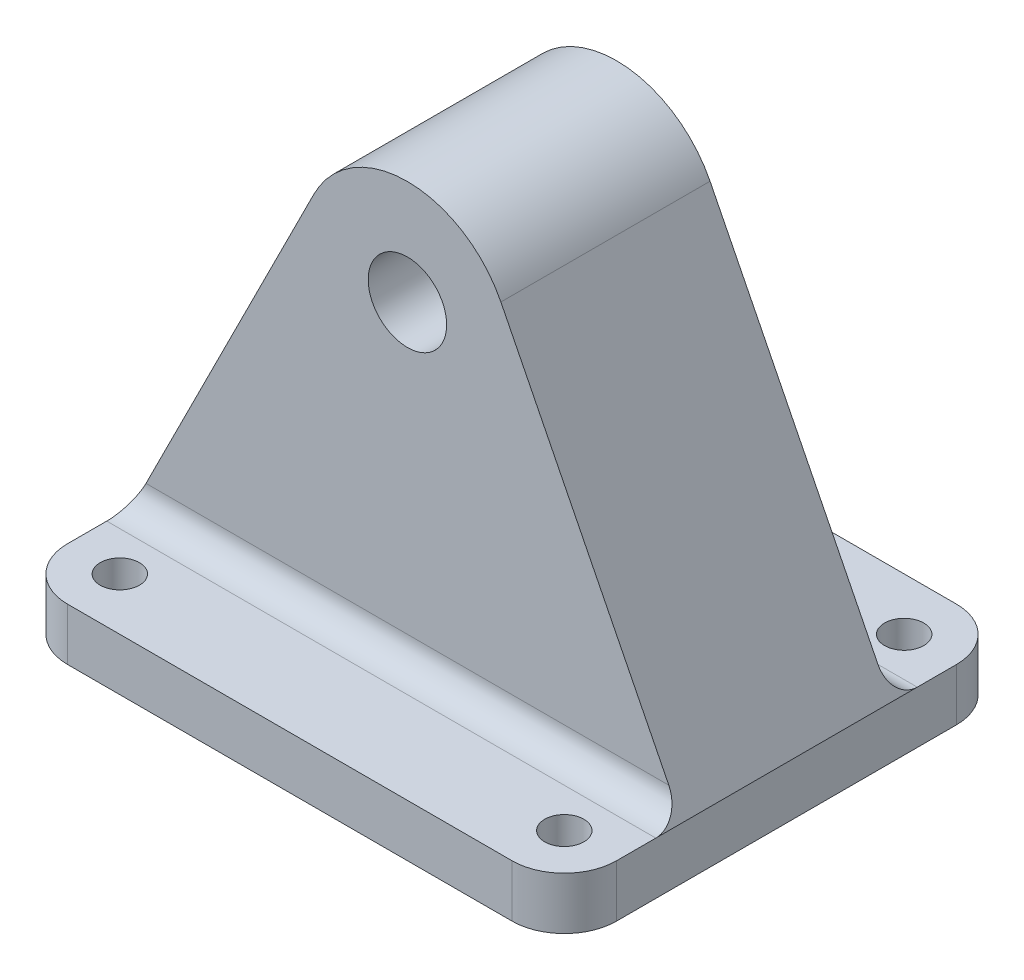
ISO-10303-21;
HEADER;
FILE_DESCRIPTION(('STEP AP214'),'2;1');
FILE_NAME('part.step','',(''),(''),'','','');
FILE_SCHEMA(('AUTOMOTIVE_DESIGN { 1 0 10303 214 1 1 1 1 }'));
ENDSEC;
DATA;
#1=APPLICATION_CONTEXT('core data for automotive mechanical design processes');
#2=APPLICATION_PROTOCOL_DEFINITION('international standard','automotive_design',2000,#1);
#3=PRODUCT_CONTEXT('',#1,'mechanical');
#4=PRODUCT('Part','Part','',(#3));
#5=PRODUCT_RELATED_PRODUCT_CATEGORY('part','',(#4));
#6=PRODUCT_DEFINITION_FORMATION('','',#4);
#7=PRODUCT_DEFINITION_CONTEXT('part definition',#1,'design');
#8=PRODUCT_DEFINITION('design','',#6,#7);
#9=PRODUCT_DEFINITION_SHAPE('','',#8);
#10=(LENGTH_UNIT() NAMED_UNIT(*) SI_UNIT(.MILLI.,.METRE.));
#11=(NAMED_UNIT(*) PLANE_ANGLE_UNIT() SI_UNIT($,.RADIAN.));
#12=(NAMED_UNIT(*) SI_UNIT($,.STERADIAN.) SOLID_ANGLE_UNIT());
#13=UNCERTAINTY_MEASURE_WITH_UNIT(LENGTH_MEASURE(1.E-05),#10,'distance_accuracy_value','');
#14=(GEOMETRIC_REPRESENTATION_CONTEXT(3) GLOBAL_UNCERTAINTY_ASSIGNED_CONTEXT((#13)) GLOBAL_UNIT_ASSIGNED_CONTEXT((#10,
#11,#12)) REPRESENTATION_CONTEXT('',''));
#15=CARTESIAN_POINT('',(0.,0.,0.));
#16=DIRECTION('',(0.,0.,1.));
#17=DIRECTION('',(1.,0.,0.));
#18=AXIS2_PLACEMENT_3D('',#15,#16,#17);
#19=CARTESIAN_POINT('',(-26.9875,6.35,20.6375));
#20=DIRECTION('',(0.,1.,0.));
#21=DIRECTION('',(0.,0.,1.));
#22=AXIS2_PLACEMENT_3D('',#19,#20,#21);
#23=PLANE('',#22);
#24=CARTESIAN_POINT('',(26.9875,6.35,-20.6375));
#25=DIRECTION('',(0.,1.,0.));
#26=DIRECTION('',(0.,0.,1.));
#27=AXIS2_PLACEMENT_3D('',#24,#25,#26);
#28=CIRCLE('',#27,2.38125);
#29=CARTESIAN_POINT('',(26.9875,6.35,-18.25625));
#30=VERTEX_POINT('',#29);
#31=EDGE_CURVE('E183',#30,#30,#28,.T.);
#32=ORIENTED_EDGE('',*,*,#31,.F.);
#33=EDGE_LOOP('',(#32));
#34=FACE_BOUND('',#33,.T.);
#35=CARTESIAN_POINT('',(-26.9875,6.35,-20.6375));
#36=DIRECTION('',(0.,1.,0.));
#37=DIRECTION('',(0.,0.,1.));
#38=AXIS2_PLACEMENT_3D('',#35,#36,#37);
#39=CIRCLE('',#38,2.38125);
#40=CARTESIAN_POINT('',(-26.9875,6.35,-18.25625));
#41=VERTEX_POINT('',#40);
#42=EDGE_CURVE('E189',#41,#41,#39,.T.);
#43=ORIENTED_EDGE('',*,*,#42,.F.);
#44=EDGE_LOOP('',(#43));
#45=FACE_BOUND('',#44,.T.);
#46=DIRECTION('',(0.,0.,1.));
#47=VECTOR('',#46,1.);
#48=CARTESIAN_POINT('',(-33.3375,6.35,-20.6375));
#49=LINE('',#48,#47);
#50=CARTESIAN_POINT('',(-33.3375,6.35,-20.6375));
#51=VERTEX_POINT('',#50);
#52=CARTESIAN_POINT('',(-33.3375,6.35,-15.875));
#53=VERTEX_POINT('',#52);
#54=EDGE_CURVE('E213',#51,#53,#49,.T.);
#55=ORIENTED_EDGE('',*,*,#54,.T.);
#56=DIRECTION('',(1.,0.,0.));
#57=VECTOR('',#56,1.);
#58=CARTESIAN_POINT('',(-26.9875,6.35,-15.875));
#59=LINE('',#58,#57);
#60=CARTESIAN_POINT('',(33.3375,6.35,-15.875));
#61=VERTEX_POINT('',#60);
#62=EDGE_CURVE('E255',#53,#61,#59,.T.);
#63=ORIENTED_EDGE('',*,*,#62,.T.);
#64=DIRECTION('',(0.,0.,-1.));
#65=VECTOR('',#64,1.);
#66=CARTESIAN_POINT('',(33.3375,6.35,-20.6375));
#67=LINE('',#66,#65);
#68=CARTESIAN_POINT('',(33.3375,6.35,-20.6375));
#69=VERTEX_POINT('',#68);
#70=EDGE_CURVE('E203',#61,#69,#67,.T.);
#71=ORIENTED_EDGE('',*,*,#70,.T.);
#72=CARTESIAN_POINT('',(26.9875,6.35,-20.6375));
#73=DIRECTION('',(0.,1.,0.));
#74=DIRECTION('',(0.,0.,1.));
#75=AXIS2_PLACEMENT_3D('',#72,#73,#74);
#76=CIRCLE('',#75,6.35);
#77=CARTESIAN_POINT('',(26.9875,6.35,-26.9875));
#78=VERTEX_POINT('',#77);
#79=EDGE_CURVE('E206',#69,#78,#76,.T.);
#80=ORIENTED_EDGE('',*,*,#79,.T.);
#81=DIRECTION('',(-1.,0.,0.));
#82=VECTOR('',#81,1.);
#83=CARTESIAN_POINT('',(-26.9875,6.35,-26.9875));
#84=LINE('',#83,#82);
#85=CARTESIAN_POINT('',(-26.9875,6.35,-26.9875));
#86=VERTEX_POINT('',#85);
#87=EDGE_CURVE('E208',#78,#86,#84,.T.);
#88=ORIENTED_EDGE('',*,*,#87,.T.);
#89=CARTESIAN_POINT('',(-26.9875,6.35,-20.6375));
#90=DIRECTION('',(0.,1.,0.));
#91=DIRECTION('',(0.,0.,1.));
#92=AXIS2_PLACEMENT_3D('',#89,#90,#91);
#93=CIRCLE('',#92,6.35);
#94=EDGE_CURVE('E210',#86,#51,#93,.T.);
#95=ORIENTED_EDGE('',*,*,#94,.T.);
#96=EDGE_LOOP('',(#55,#63,#71,#80,#88,#95));
#97=FACE_BOUND('',#96,.T.);
#98=ADVANCED_FACE('F33',(#34,#45,#97),#23,.T.);
#99=CARTESIAN_POINT('',(33.3375,6.35,20.6375));
#100=VERTEX_POINT('',#99);
#101=CARTESIAN_POINT('',(33.3375,6.35,15.875));
#102=VERTEX_POINT('',#101);
#103=EDGE_CURVE('E204',#100,#102,#67,.T.);
#104=ORIENTED_EDGE('',*,*,#103,.T.);
#105=DIRECTION('',(1.,0.,0.));
#106=VECTOR('',#105,1.);
#107=CARTESIAN_POINT('',(-33.3375,6.35,15.875));
#108=LINE('',#107,#106);
#109=CARTESIAN_POINT('',(-33.3375,6.35,15.875));
#110=VERTEX_POINT('',#109);
#111=EDGE_CURVE('E261',#102,#110,#108,.F.);
#112=ORIENTED_EDGE('',*,*,#111,.T.);
#113=CARTESIAN_POINT('',(-33.3375,6.35,20.6375));
#114=VERTEX_POINT('',#113);
#115=EDGE_CURVE('E212',#110,#114,#49,.T.);
#116=ORIENTED_EDGE('',*,*,#115,.T.);
#117=CARTESIAN_POINT('',(-26.9875,6.35,20.6375));
#118=DIRECTION('',(0.,1.,0.));
#119=DIRECTION('',(0.,0.,1.));
#120=AXIS2_PLACEMENT_3D('',#117,#118,#119);
#121=CIRCLE('',#120,6.35);
#122=CARTESIAN_POINT('',(-26.9875,6.35,26.9875));
#123=VERTEX_POINT('',#122);
#124=EDGE_CURVE('E195',#114,#123,#121,.T.);
#125=ORIENTED_EDGE('',*,*,#124,.T.);
#126=DIRECTION('',(1.,0.,0.));
#127=VECTOR('',#126,1.);
#128=CARTESIAN_POINT('',(-26.9875,6.35,26.9875));
#129=LINE('',#128,#127);
#130=CARTESIAN_POINT('',(26.9875,6.35,26.9875));
#131=VERTEX_POINT('',#130);
#132=EDGE_CURVE('E198',#123,#131,#129,.T.);
#133=ORIENTED_EDGE('',*,*,#132,.T.);
#134=CARTESIAN_POINT('',(26.9875,6.35,20.6375));
#135=DIRECTION('',(0.,1.,0.));
#136=DIRECTION('',(0.,0.,1.));
#137=AXIS2_PLACEMENT_3D('',#134,#135,#136);
#138=CIRCLE('',#137,6.35000000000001);
#139=EDGE_CURVE('E201',#131,#100,#138,.T.);
#140=ORIENTED_EDGE('',*,*,#139,.T.);
#141=EDGE_LOOP('',(#104,#112,#116,#125,#133,#140));
#142=FACE_BOUND('',#141,.T.);
#143=CARTESIAN_POINT('',(26.9875,6.35,20.6375));
#144=DIRECTION('',(0.,1.,0.));
#145=DIRECTION('',(0.,0.,1.));
#146=AXIS2_PLACEMENT_3D('',#143,#144,#145);
#147=CIRCLE('',#146,2.38125);
#148=CARTESIAN_POINT('',(26.9875,6.35,23.01875));
#149=VERTEX_POINT('',#148);
#150=EDGE_CURVE('E177',#149,#149,#147,.T.);
#151=ORIENTED_EDGE('',*,*,#150,.F.);
#152=EDGE_LOOP('',(#151));
#153=FACE_BOUND('',#152,.T.);
#154=CARTESIAN_POINT('',(-26.9875,6.35,20.6375));
#155=DIRECTION('',(0.,1.,0.));
#156=DIRECTION('',(0.,0.,1.));
#157=AXIS2_PLACEMENT_3D('',#154,#155,#156);
#158=CIRCLE('',#157,2.38125);
#159=CARTESIAN_POINT('',(-26.9875,6.35,23.01875));
#160=VERTEX_POINT('',#159);
#161=EDGE_CURVE('E171',#160,#160,#158,.T.);
#162=ORIENTED_EDGE('',*,*,#161,.F.);
#163=EDGE_LOOP('',(#162));
#164=FACE_BOUND('',#163,.T.);
#165=ADVANCED_FACE('F274',(#142,#153,#164),#23,.T.);
#166=CARTESIAN_POINT('',(-26.9875,0.,20.6375));
#167=DIRECTION('',(0.,1.,0.));
#168=DIRECTION('',(0.,0.,1.));
#169=AXIS2_PLACEMENT_3D('',#166,#167,#168);
#170=PLANE('',#169);
#171=CARTESIAN_POINT('',(-26.9875,0.,20.6375));
#172=DIRECTION('',(0.,1.,0.));
#173=DIRECTION('',(0.,0.,1.));
#174=AXIS2_PLACEMENT_3D('',#171,#172,#173);
#175=CIRCLE('',#174,6.35);
#176=CARTESIAN_POINT('',(-33.3375,0.,20.6375));
#177=VERTEX_POINT('',#176);
#178=CARTESIAN_POINT('',(-26.9875,0.,26.9875));
#179=VERTEX_POINT('',#178);
#180=EDGE_CURVE('E192',#177,#179,#175,.T.);
#181=ORIENTED_EDGE('',*,*,#180,.F.);
#182=DIRECTION('',(0.,0.,1.));
#183=VECTOR('',#182,1.);
#184=CARTESIAN_POINT('',(-33.3375,0.,-20.6375));
#185=LINE('',#184,#183);
#186=CARTESIAN_POINT('',(-33.3375,0.,-20.6375));
#187=VERTEX_POINT('',#186);
#188=EDGE_CURVE('E199',#187,#177,#185,.T.);
#189=ORIENTED_EDGE('',*,*,#188,.F.);
#190=CARTESIAN_POINT('',(-26.9875,0.,-20.6375));
#191=DIRECTION('',(0.,1.,0.));
#192=DIRECTION('',(0.,0.,1.));
#193=AXIS2_PLACEMENT_3D('',#190,#191,#192);
#194=CIRCLE('',#193,6.35);
#195=CARTESIAN_POINT('',(-26.9875,0.,-26.9875));
#196=VERTEX_POINT('',#195);
#197=EDGE_CURVE('E229',#196,#187,#194,.T.);
#198=ORIENTED_EDGE('',*,*,#197,.F.);
#199=DIRECTION('',(-1.,0.,0.));
#200=VECTOR('',#199,1.);
#201=CARTESIAN_POINT('',(-26.9875,0.,-26.9875));
#202=LINE('',#201,#200);
#203=CARTESIAN_POINT('',(26.9875,0.,-26.9875));
#204=VERTEX_POINT('',#203);
#205=EDGE_CURVE('E227',#204,#196,#202,.T.);
#206=ORIENTED_EDGE('',*,*,#205,.F.);
#207=CARTESIAN_POINT('',(26.9875,0.,-20.6375));
#208=DIRECTION('',(0.,1.,0.));
#209=DIRECTION('',(0.,0.,1.));
#210=AXIS2_PLACEMENT_3D('',#207,#208,#209);
#211=CIRCLE('',#210,6.35);
#212=CARTESIAN_POINT('',(33.3375,0.,-20.6375));
#213=VERTEX_POINT('',#212);
#214=EDGE_CURVE('E225',#213,#204,#211,.T.);
#215=ORIENTED_EDGE('',*,*,#214,.F.);
#216=DIRECTION('',(0.,0.,-1.));
#217=VECTOR('',#216,1.);
#218=CARTESIAN_POINT('',(33.3375,0.,-20.6375));
#219=LINE('',#218,#217);
#220=CARTESIAN_POINT('',(33.3375,0.,20.6375));
#221=VERTEX_POINT('',#220);
#222=EDGE_CURVE('E223',#221,#213,#219,.T.);
#223=ORIENTED_EDGE('',*,*,#222,.F.);
#224=CARTESIAN_POINT('',(26.9875,0.,20.6375));
#225=DIRECTION('',(0.,1.,0.));
#226=DIRECTION('',(0.,0.,1.));
#227=AXIS2_PLACEMENT_3D('',#224,#225,#226);
#228=CIRCLE('',#227,6.35000000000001);
#229=CARTESIAN_POINT('',(26.9875,0.,26.9875));
#230=VERTEX_POINT('',#229);
#231=EDGE_CURVE('E221',#230,#221,#228,.T.);
#232=ORIENTED_EDGE('',*,*,#231,.F.);
#233=DIRECTION('',(1.,0.,0.));
#234=VECTOR('',#233,1.);
#235=CARTESIAN_POINT('',(-26.9875,0.,26.9875));
#236=LINE('',#235,#234);
#237=EDGE_CURVE('E219',#179,#230,#236,.T.);
#238=ORIENTED_EDGE('',*,*,#237,.F.);
#239=EDGE_LOOP('',(#181,#189,#198,#206,#215,#223,#232,#238));
#240=FACE_BOUND('',#239,.T.);
#241=CARTESIAN_POINT('',(-26.9875,0.,-20.6375));
#242=DIRECTION('',(0.,1.,0.));
#243=DIRECTION('',(0.,0.,1.));
#244=AXIS2_PLACEMENT_3D('',#241,#242,#243);
#245=CIRCLE('',#244,2.38125);
#246=CARTESIAN_POINT('',(-26.9875,0.,-18.25625));
#247=VERTEX_POINT('',#246);
#248=EDGE_CURVE('E186',#247,#247,#245,.T.);
#249=ORIENTED_EDGE('',*,*,#248,.T.);
#250=EDGE_LOOP('',(#249));
#251=FACE_BOUND('',#250,.T.);
#252=CARTESIAN_POINT('',(26.9875,0.,-20.6375));
#253=DIRECTION('',(0.,1.,0.));
#254=DIRECTION('',(0.,0.,1.));
#255=AXIS2_PLACEMENT_3D('',#252,#253,#254);
#256=CIRCLE('',#255,2.38125);
#257=CARTESIAN_POINT('',(26.9875,0.,-18.25625));
#258=VERTEX_POINT('',#257);
#259=EDGE_CURVE('E180',#258,#258,#256,.T.);
#260=ORIENTED_EDGE('',*,*,#259,.T.);
#261=EDGE_LOOP('',(#260));
#262=FACE_BOUND('',#261,.T.);
#263=CARTESIAN_POINT('',(26.9875,0.,20.6375));
#264=DIRECTION('',(0.,1.,0.));
#265=DIRECTION('',(0.,0.,1.));
#266=AXIS2_PLACEMENT_3D('',#263,#264,#265);
#267=CIRCLE('',#266,2.38125);
#268=CARTESIAN_POINT('',(26.9875,0.,23.01875));
#269=VERTEX_POINT('',#268);
#270=EDGE_CURVE('E174',#269,#269,#267,.T.);
#271=ORIENTED_EDGE('',*,*,#270,.T.);
#272=EDGE_LOOP('',(#271));
#273=FACE_BOUND('',#272,.T.);
#274=CARTESIAN_POINT('',(-26.9875,0.,20.6375));
#275=DIRECTION('',(0.,1.,0.));
#276=DIRECTION('',(0.,0.,1.));
#277=AXIS2_PLACEMENT_3D('',#274,#275,#276);
#278=CIRCLE('',#277,2.38125);
#279=CARTESIAN_POINT('',(-26.9875,0.,23.01875));
#280=VERTEX_POINT('',#279);
#281=EDGE_CURVE('E170',#280,#280,#278,.T.);
#282=ORIENTED_EDGE('',*,*,#281,.T.);
#283=EDGE_LOOP('',(#282));
#284=FACE_BOUND('',#283,.T.);
#285=ADVANCED_FACE('F315',(#240,#251,#262,#273,#284),#170,.F.);
#286=CARTESIAN_POINT('',(-26.9875,6.35,20.6375));
#287=DIRECTION('',(0.,-1.,0.));
#288=DIRECTION('',(0.,0.,-1.));
#289=AXIS2_PLACEMENT_3D('',#286,#287,#288);
#290=CYLINDRICAL_SURFACE('',#289,6.35);
#291=ORIENTED_EDGE('',*,*,#180,.T.);
#292=DIRECTION('',(0.,-1.,0.));
#293=VECTOR('',#292,1.);
#294=CARTESIAN_POINT('',(-26.9875,6.35,26.9875));
#295=LINE('',#294,#293);
#296=EDGE_CURVE('E252',#123,#179,#295,.T.);
#297=ORIENTED_EDGE('',*,*,#296,.F.);
#298=ORIENTED_EDGE('',*,*,#124,.F.);
#299=DIRECTION('',(0.,-1.,0.));
#300=VECTOR('',#299,1.);
#301=CARTESIAN_POINT('',(-33.3375,6.35,20.6375));
#302=LINE('',#301,#300);
#303=EDGE_CURVE('E216',#114,#177,#302,.T.);
#304=ORIENTED_EDGE('',*,*,#303,.T.);
#305=EDGE_LOOP('',(#291,#297,#298,#304));
#306=FACE_BOUND('',#305,.T.);
#307=ADVANCED_FACE('F286',(#306),#290,.T.);
#308=CARTESIAN_POINT('',(-26.9875,6.35,26.9875));
#309=DIRECTION('',(0.,0.,-1.));
#310=DIRECTION('',(-1.,0.,0.));
#311=AXIS2_PLACEMENT_3D('',#308,#309,#310);
#312=PLANE('',#311);
#313=ORIENTED_EDGE('',*,*,#237,.T.);
#314=DIRECTION('',(0.,-1.,0.));
#315=VECTOR('',#314,1.);
#316=CARTESIAN_POINT('',(26.9875,6.35,26.9875));
#317=LINE('',#316,#315);
#318=EDGE_CURVE('E249',#131,#230,#317,.T.);
#319=ORIENTED_EDGE('',*,*,#318,.F.);
#320=ORIENTED_EDGE('',*,*,#132,.F.);
#321=ORIENTED_EDGE('',*,*,#296,.T.);
#322=EDGE_LOOP('',(#313,#319,#320,#321));
#323=FACE_BOUND('',#322,.T.);
#324=ADVANCED_FACE('F291',(#323),#312,.F.);
#325=CARTESIAN_POINT('',(26.9875,6.35,20.6375));
#326=DIRECTION('',(0.,-1.,0.));
#327=DIRECTION('',(0.,0.,-1.));
#328=AXIS2_PLACEMENT_3D('',#325,#326,#327);
#329=CYLINDRICAL_SURFACE('',#328,6.35000000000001);
#330=ORIENTED_EDGE('',*,*,#231,.T.);
#331=DIRECTION('',(0.,-1.,0.));
#332=VECTOR('',#331,1.);
#333=CARTESIAN_POINT('',(33.3375,6.35,20.6375));
#334=LINE('',#333,#332);
#335=EDGE_CURVE('E246',#100,#221,#334,.T.);
#336=ORIENTED_EDGE('',*,*,#335,.F.);
#337=ORIENTED_EDGE('',*,*,#139,.F.);
#338=ORIENTED_EDGE('',*,*,#318,.T.);
#339=EDGE_LOOP('',(#330,#336,#337,#338));
#340=FACE_BOUND('',#339,.T.);
#341=ADVANCED_FACE('F294',(#340),#329,.T.);
#342=CARTESIAN_POINT('',(33.3375,6.35,-20.6375));
#343=DIRECTION('',(-1.,0.,0.));
#344=DIRECTION('',(0.,0.,1.));
#345=AXIS2_PLACEMENT_3D('',#342,#343,#344);
#346=PLANE('',#345);
#347=ORIENTED_EDGE('',*,*,#222,.T.);
#348=DIRECTION('',(0.,-1.,0.));
#349=VECTOR('',#348,1.);
#350=CARTESIAN_POINT('',(33.3375,6.35,-20.6375));
#351=LINE('',#350,#349);
#352=EDGE_CURVE('E243',#69,#213,#351,.T.);
#353=ORIENTED_EDGE('',*,*,#352,.F.);
#354=ORIENTED_EDGE('',*,*,#70,.F.);
#355=DIRECTION('',(0.,0.,-1.));
#356=VECTOR('',#355,1.);
#357=CARTESIAN_POINT('',(33.3375,6.35,12.7));
#358=LINE('',#357,#356);
#359=EDGE_CURVE('E49',#102,#61,#358,.T.);
#360=ORIENTED_EDGE('',*,*,#359,.F.);
#361=ORIENTED_EDGE('',*,*,#103,.F.);
#362=ORIENTED_EDGE('',*,*,#335,.T.);
#363=EDGE_LOOP('',(#347,#353,#354,#360,#361,#362));
#364=FACE_BOUND('',#363,.T.);
#365=ADVANCED_FACE('F296',(#364),#346,.F.);
#366=CARTESIAN_POINT('',(26.9875,6.35,-20.6375));
#367=DIRECTION('',(0.,-1.,0.));
#368=DIRECTION('',(0.,0.,-1.));
#369=AXIS2_PLACEMENT_3D('',#366,#367,#368);
#370=CYLINDRICAL_SURFACE('',#369,6.35);
#371=ORIENTED_EDGE('',*,*,#214,.T.);
#372=DIRECTION('',(0.,-1.,0.));
#373=VECTOR('',#372,1.);
#374=CARTESIAN_POINT('',(26.9875,6.35,-26.9875));
#375=LINE('',#374,#373);
#376=EDGE_CURVE('E240',#78,#204,#375,.T.);
#377=ORIENTED_EDGE('',*,*,#376,.F.);
#378=ORIENTED_EDGE('',*,*,#79,.F.);
#379=ORIENTED_EDGE('',*,*,#352,.T.);
#380=EDGE_LOOP('',(#371,#377,#378,#379));
#381=FACE_BOUND('',#380,.T.);
#382=ADVANCED_FACE('F299',(#381),#370,.T.);
#383=CARTESIAN_POINT('',(-26.9875,6.35,-26.9875));
#384=DIRECTION('',(0.,0.,1.));
#385=DIRECTION('',(1.,0.,0.));
#386=AXIS2_PLACEMENT_3D('',#383,#384,#385);
#387=PLANE('',#386);
#388=ORIENTED_EDGE('',*,*,#205,.T.);
#389=DIRECTION('',(0.,-1.,0.));
#390=VECTOR('',#389,1.);
#391=CARTESIAN_POINT('',(-26.9875,6.35,-26.9875));
#392=LINE('',#391,#390);
#393=EDGE_CURVE('E237',#86,#196,#392,.T.);
#394=ORIENTED_EDGE('',*,*,#393,.F.);
#395=ORIENTED_EDGE('',*,*,#87,.F.);
#396=ORIENTED_EDGE('',*,*,#376,.T.);
#397=EDGE_LOOP('',(#388,#394,#395,#396));
#398=FACE_BOUND('',#397,.T.);
#399=ADVANCED_FACE('F305',(#398),#387,.F.);
#400=CARTESIAN_POINT('',(-26.9875,6.35,-20.6375));
#401=DIRECTION('',(0.,-1.,0.));
#402=DIRECTION('',(0.,0.,-1.));
#403=AXIS2_PLACEMENT_3D('',#400,#401,#402);
#404=CYLINDRICAL_SURFACE('',#403,6.35);
#405=ORIENTED_EDGE('',*,*,#197,.T.);
#406=DIRECTION('',(0.,-1.,0.));
#407=VECTOR('',#406,1.);
#408=CARTESIAN_POINT('',(-33.3375,6.35,-20.6375));
#409=LINE('',#408,#407);
#410=EDGE_CURVE('E234',#51,#187,#409,.T.);
#411=ORIENTED_EDGE('',*,*,#410,.F.);
#412=ORIENTED_EDGE('',*,*,#94,.F.);
#413=ORIENTED_EDGE('',*,*,#393,.T.);
#414=EDGE_LOOP('',(#405,#411,#412,#413));
#415=FACE_BOUND('',#414,.T.);
#416=ADVANCED_FACE('F327',(#415),#404,.T.);
#417=CARTESIAN_POINT('',(-33.3375,6.35,-20.6375));
#418=DIRECTION('',(1.,0.,0.));
#419=DIRECTION('',(0.,0.,-1.));
#420=AXIS2_PLACEMENT_3D('',#417,#418,#419);
#421=PLANE('',#420);
#422=ORIENTED_EDGE('',*,*,#188,.T.);
#423=ORIENTED_EDGE('',*,*,#303,.F.);
#424=ORIENTED_EDGE('',*,*,#115,.F.);
#425=DIRECTION('',(0.,0.,-1.));
#426=VECTOR('',#425,1.);
#427=CARTESIAN_POINT('',(-33.3375,6.35,12.7));
#428=LINE('',#427,#426);
#429=EDGE_CURVE('E157',#110,#53,#428,.T.);
#430=ORIENTED_EDGE('',*,*,#429,.T.);
#431=ORIENTED_EDGE('',*,*,#54,.F.);
#432=ORIENTED_EDGE('',*,*,#410,.T.);
#433=EDGE_LOOP('',(#422,#423,#424,#430,#431,#432));
#434=FACE_BOUND('',#433,.T.);
#435=ADVANCED_FACE('F279',(#434),#421,.F.);
#436=CARTESIAN_POINT('',(-26.9875,6.35,-20.6375));
#437=DIRECTION('',(0.,-1.,0.));
#438=DIRECTION('',(0.,0.,-1.));
#439=AXIS2_PLACEMENT_3D('',#436,#437,#438);
#440=CYLINDRICAL_SURFACE('',#439,2.38125);
#441=ORIENTED_EDGE('',*,*,#42,.T.);
#442=EDGE_LOOP('',(#441));
#443=FACE_BOUND('',#442,.T.);
#444=ORIENTED_EDGE('',*,*,#248,.F.);
#445=EDGE_LOOP('',(#444));
#446=FACE_BOUND('',#445,.T.);
#447=ADVANCED_FACE('F320',(#443,#446),#440,.F.);
#448=CARTESIAN_POINT('',(26.9875,6.35,-20.6375));
#449=DIRECTION('',(0.,-1.,0.));
#450=DIRECTION('',(0.,0.,-1.));
#451=AXIS2_PLACEMENT_3D('',#448,#449,#450);
#452=CYLINDRICAL_SURFACE('',#451,2.38125);
#453=ORIENTED_EDGE('',*,*,#31,.T.);
#454=EDGE_LOOP('',(#453));
#455=FACE_BOUND('',#454,.T.);
#456=ORIENTED_EDGE('',*,*,#259,.F.);
#457=EDGE_LOOP('',(#456));
#458=FACE_BOUND('',#457,.T.);
#459=ADVANCED_FACE('F378',(#455,#458),#452,.F.);
#460=CARTESIAN_POINT('',(26.9875,6.35,20.6375));
#461=DIRECTION('',(0.,-1.,0.));
#462=DIRECTION('',(0.,0.,-1.));
#463=AXIS2_PLACEMENT_3D('',#460,#461,#462);
#464=CYLINDRICAL_SURFACE('',#463,2.38125);
#465=ORIENTED_EDGE('',*,*,#150,.T.);
#466=EDGE_LOOP('',(#465));
#467=FACE_BOUND('',#466,.T.);
#468=ORIENTED_EDGE('',*,*,#270,.F.);
#469=EDGE_LOOP('',(#468));
#470=FACE_BOUND('',#469,.T.);
#471=ADVANCED_FACE('F375',(#467,#470),#464,.F.);
#472=CARTESIAN_POINT('',(-26.9875,6.35,20.6375));
#473=DIRECTION('',(0.,-1.,0.));
#474=DIRECTION('',(0.,0.,-1.));
#475=AXIS2_PLACEMENT_3D('',#472,#473,#474);
#476=CYLINDRICAL_SURFACE('',#475,2.38125);
#477=ORIENTED_EDGE('',*,*,#161,.T.);
#478=EDGE_LOOP('',(#477));
#479=FACE_BOUND('',#478,.T.);
#480=ORIENTED_EDGE('',*,*,#281,.F.);
#481=EDGE_LOOP('',(#480));
#482=FACE_BOUND('',#481,.T.);
#483=ADVANCED_FACE('F372',(#479,#482),#476,.F.);
#484=CARTESIAN_POINT('',(0.,44.45,12.7));
#485=DIRECTION('',(0.,0.,1.));
#486=DIRECTION('',(1.,0.,0.));
#487=AXIS2_PLACEMENT_3D('',#484,#485,#486);
#488=PLANE('',#487);
#489=DIRECTION('',(-0.448657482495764,-0.893703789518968,0.));
#490=VECTOR('',#489,1.);
#491=CARTESIAN_POINT('',(-33.3375,6.35,12.7));
#492=LINE('',#491,#490);
#493=CARTESIAN_POINT('',(-11.3500381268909,50.1479500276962,12.7));
#494=VERTEX_POINT('',#493);
#495=CARTESIAN_POINT('',(-31.7435854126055,9.525,12.7));
#496=VERTEX_POINT('',#495);
#497=EDGE_CURVE('E155',#494,#496,#492,.T.);
#498=ORIENTED_EDGE('',*,*,#497,.T.);
#499=DIRECTION('',(1.,0.,0.));
#500=VECTOR('',#499,1.);
#501=CARTESIAN_POINT('',(33.3375,9.525,12.7));
#502=LINE('',#501,#500);
#503=CARTESIAN_POINT('',(31.7435854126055,9.52500000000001,12.7));
#504=VERTEX_POINT('',#503);
#505=EDGE_CURVE('E138',#496,#504,#502,.T.);
#506=ORIENTED_EDGE('',*,*,#505,.T.);
#507=DIRECTION('',(-0.448657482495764,0.893703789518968,0.));
#508=VECTOR('',#507,1.);
#509=CARTESIAN_POINT('',(11.3500381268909,50.1479500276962,12.7));
#510=LINE('',#509,#508);
#511=CARTESIAN_POINT('',(11.3500381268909,50.1479500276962,12.7));
#512=VERTEX_POINT('',#511);
#513=EDGE_CURVE('E129',#504,#512,#510,.T.);
#514=ORIENTED_EDGE('',*,*,#513,.T.);
#515=CARTESIAN_POINT('',(0.,44.45,12.7));
#516=DIRECTION('',(0.,0.,1.));
#517=DIRECTION('',(1.,0.,0.));
#518=AXIS2_PLACEMENT_3D('',#515,#516,#517);
#519=CIRCLE('',#518,12.7);
#520=EDGE_CURVE('E135',#512,#494,#519,.T.);
#521=ORIENTED_EDGE('',*,*,#520,.T.);
#522=EDGE_LOOP('',(#498,#506,#514,#521));
#523=FACE_BOUND('',#522,.T.);
#524=CARTESIAN_POINT('',(0.,44.45,12.7));
#525=DIRECTION('',(0.,0.,1.));
#526=DIRECTION('',(1.,0.,0.));
#527=AXIS2_PLACEMENT_3D('',#524,#525,#526);
#528=CIRCLE('',#527,4.7625);
#529=CARTESIAN_POINT('',(4.76250000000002,44.45,12.7));
#530=VERTEX_POINT('',#529);
#531=EDGE_CURVE('E163',#530,#530,#528,.T.);
#532=ORIENTED_EDGE('',*,*,#531,.F.);
#533=EDGE_LOOP('',(#532));
#534=FACE_BOUND('',#533,.T.);
#535=ADVANCED_FACE('F132',(#523,#534),#488,.T.);
#536=CARTESIAN_POINT('',(0.,44.45,-12.7));
#537=DIRECTION('',(0.,0.,1.));
#538=DIRECTION('',(1.,0.,0.));
#539=AXIS2_PLACEMENT_3D('',#536,#537,#538);
#540=PLANE('',#539);
#541=DIRECTION('',(-0.448657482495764,0.893703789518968,0.));
#542=VECTOR('',#541,1.);
#543=CARTESIAN_POINT('',(11.3500381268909,50.1479500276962,-12.7));
#544=LINE('',#543,#542);
#545=CARTESIAN_POINT('',(31.7435854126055,9.52500000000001,-12.7));
#546=VERTEX_POINT('',#545);
#547=CARTESIAN_POINT('',(11.3500381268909,50.1479500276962,-12.7));
#548=VERTEX_POINT('',#547);
#549=EDGE_CURVE('E147',#546,#548,#544,.T.);
#550=ORIENTED_EDGE('',*,*,#549,.F.);
#551=DIRECTION('',(1.,0.,0.));
#552=VECTOR('',#551,1.);
#553=CARTESIAN_POINT('',(0.,9.525,-12.7));
#554=LINE('',#553,#552);
#555=CARTESIAN_POINT('',(-31.7435854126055,9.525,-12.7));
#556=VERTEX_POINT('',#555);
#557=EDGE_CURVE('E258',#546,#556,#554,.F.);
#558=ORIENTED_EDGE('',*,*,#557,.T.);
#559=DIRECTION('',(-0.448657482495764,-0.893703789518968,0.));
#560=VECTOR('',#559,1.);
#561=CARTESIAN_POINT('',(-33.3375,6.35,-12.7));
#562=LINE('',#561,#560);
#563=CARTESIAN_POINT('',(-11.3500381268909,50.1479500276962,-12.7));
#564=VERTEX_POINT('',#563);
#565=EDGE_CURVE('E141',#564,#556,#562,.T.);
#566=ORIENTED_EDGE('',*,*,#565,.F.);
#567=CARTESIAN_POINT('',(0.,44.45,-12.7));
#568=DIRECTION('',(0.,0.,1.));
#569=DIRECTION('',(1.,0.,0.));
#570=AXIS2_PLACEMENT_3D('',#567,#568,#569);
#571=CIRCLE('',#570,12.7);
#572=EDGE_CURVE('E162',#548,#564,#571,.T.);
#573=ORIENTED_EDGE('',*,*,#572,.F.);
#574=EDGE_LOOP('',(#550,#558,#566,#573));
#575=FACE_BOUND('',#574,.T.);
#576=CARTESIAN_POINT('',(0.,44.45,-12.7));
#577=DIRECTION('',(0.,0.,1.));
#578=DIRECTION('',(1.,0.,0.));
#579=AXIS2_PLACEMENT_3D('',#576,#577,#578);
#580=CIRCLE('',#579,4.7625);
#581=CARTESIAN_POINT('',(4.76250000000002,44.45,-12.7));
#582=VERTEX_POINT('',#581);
#583=EDGE_CURVE('E542',#582,#582,#580,.T.);
#584=ORIENTED_EDGE('',*,*,#583,.T.);
#585=EDGE_LOOP('',(#584));
#586=FACE_BOUND('',#585,.T.);
#587=ADVANCED_FACE('F352',(#575,#586),#540,.F.);
#588=CARTESIAN_POINT('',(11.3500381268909,50.1479500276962,12.7));
#589=DIRECTION('',(-0.893703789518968,-0.448657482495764,0.));
#590=DIRECTION('',(0.448657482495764,-0.893703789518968,0.));
#591=AXIS2_PLACEMENT_3D('',#588,#589,#590);
#592=PLANE('',#591);
#593=ORIENTED_EDGE('',*,*,#359,.T.);
#594=CARTESIAN_POINT('',(31.7435854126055,9.525,-15.875));
#595=DIRECTION('',(-0.893703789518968,-0.448657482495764,0.));
#596=DIRECTION('',(0.448657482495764,-0.893703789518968,0.));
#597=AXIS2_PLACEMENT_3D('',#594,#595,#596);
#598=ELLIPSE('',#597,3.55263123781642,3.175);
#599=EDGE_CURVE('E264',#61,#546,#598,.T.);
#600=ORIENTED_EDGE('',*,*,#599,.T.);
#601=ORIENTED_EDGE('',*,*,#549,.T.);
#602=DIRECTION('',(0.,0.,-1.));
#603=VECTOR('',#602,1.);
#604=CARTESIAN_POINT('',(11.3500381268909,50.1479500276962,12.7));
#605=LINE('',#604,#603);
#606=EDGE_CURVE('E144',#512,#548,#605,.T.);
#607=ORIENTED_EDGE('',*,*,#606,.F.);
#608=ORIENTED_EDGE('',*,*,#513,.F.);
#609=CARTESIAN_POINT('',(31.7435854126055,9.525,15.875));
#610=DIRECTION('',(-0.893703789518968,-0.448657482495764,0.));
#611=DIRECTION('',(-0.448657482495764,0.893703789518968,0.));
#612=AXIS2_PLACEMENT_3D('',#609,#610,#611);
#613=ELLIPSE('',#612,3.55263123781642,3.175);
#614=EDGE_CURVE('E42',#504,#102,#613,.T.);
#615=ORIENTED_EDGE('',*,*,#614,.T.);
#616=EDGE_LOOP('',(#593,#600,#601,#607,#608,#615));
#617=FACE_BOUND('',#616,.T.);
#618=ADVANCED_FACE('F145',(#617),#592,.F.);
#619=CARTESIAN_POINT('',(0.,44.45,12.7));
#620=DIRECTION('',(0.,0.,-1.));
#621=DIRECTION('',(-1.,0.,0.));
#622=AXIS2_PLACEMENT_3D('',#619,#620,#621);
#623=CYLINDRICAL_SURFACE('',#622,12.7);
#624=ORIENTED_EDGE('',*,*,#572,.T.);
#625=DIRECTION('',(0.,0.,-1.));
#626=VECTOR('',#625,1.);
#627=CARTESIAN_POINT('',(-11.3500381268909,50.1479500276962,12.7));
#628=LINE('',#627,#626);
#629=EDGE_CURVE('E150',#494,#564,#628,.T.);
#630=ORIENTED_EDGE('',*,*,#629,.F.);
#631=ORIENTED_EDGE('',*,*,#520,.F.);
#632=ORIENTED_EDGE('',*,*,#606,.T.);
#633=EDGE_LOOP('',(#624,#630,#631,#632));
#634=FACE_BOUND('',#633,.T.);
#635=ADVANCED_FACE('F152',(#634),#623,.T.);
#636=CARTESIAN_POINT('',(-33.3375,6.35,12.7));
#637=DIRECTION('',(0.893703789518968,-0.448657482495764,0.));
#638=DIRECTION('',(0.448657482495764,0.893703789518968,0.));
#639=AXIS2_PLACEMENT_3D('',#636,#637,#638);
#640=PLANE('',#639);
#641=ORIENTED_EDGE('',*,*,#565,.T.);
#642=CARTESIAN_POINT('',(-31.7435854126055,9.525,-15.875));
#643=DIRECTION('',(0.893703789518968,-0.448657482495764,0.));
#644=DIRECTION('',(0.448657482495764,0.893703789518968,0.));
#645=AXIS2_PLACEMENT_3D('',#642,#643,#644);
#646=ELLIPSE('',#645,3.55263123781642,3.175);
#647=EDGE_CURVE('E266',#556,#53,#646,.T.);
#648=ORIENTED_EDGE('',*,*,#647,.T.);
#649=ORIENTED_EDGE('',*,*,#429,.F.);
#650=CARTESIAN_POINT('',(-31.7435854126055,9.525,15.875));
#651=DIRECTION('',(0.893703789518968,-0.448657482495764,0.));
#652=DIRECTION('',(-0.448657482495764,-0.893703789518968,0.));
#653=AXIS2_PLACEMENT_3D('',#650,#651,#652);
#654=ELLIPSE('',#653,3.55263123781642,3.175);
#655=EDGE_CURVE('E11',#110,#496,#654,.T.);
#656=ORIENTED_EDGE('',*,*,#655,.T.);
#657=ORIENTED_EDGE('',*,*,#497,.F.);
#658=ORIENTED_EDGE('',*,*,#629,.T.);
#659=EDGE_LOOP('',(#641,#648,#649,#656,#657,#658));
#660=FACE_BOUND('',#659,.T.);
#661=ADVANCED_FACE('F356',(#660),#640,.F.);
#662=CARTESIAN_POINT('',(0.,44.45,12.7));
#663=DIRECTION('',(0.,0.,-1.));
#664=DIRECTION('',(-1.,0.,0.));
#665=AXIS2_PLACEMENT_3D('',#662,#663,#664);
#666=CYLINDRICAL_SURFACE('',#665,4.7625);
#667=ORIENTED_EDGE('',*,*,#531,.T.);
#668=EDGE_LOOP('',(#667));
#669=FACE_BOUND('',#668,.T.);
#670=ORIENTED_EDGE('',*,*,#583,.F.);
#671=EDGE_LOOP('',(#670));
#672=FACE_BOUND('',#671,.T.);
#673=ADVANCED_FACE('F358',(#669,#672),#666,.F.);
#674=CARTESIAN_POINT('',(-26.9875,9.525,-15.875));
#675=DIRECTION('',(1.,0.,0.));
#676=DIRECTION('',(0.,0.,-1.));
#677=AXIS2_PLACEMENT_3D('',#674,#675,#676);
#678=CYLINDRICAL_SURFACE('',#677,3.175);
#679=ORIENTED_EDGE('',*,*,#647,.F.);
#680=ORIENTED_EDGE('',*,*,#557,.F.);
#681=ORIENTED_EDGE('',*,*,#599,.F.);
#682=ORIENTED_EDGE('',*,*,#62,.F.);
#683=EDGE_LOOP('',(#679,#680,#681,#682));
#684=FACE_BOUND('',#683,.T.);
#685=ADVANCED_FACE('F349',(#684),#678,.F.);
#686=CARTESIAN_POINT('',(0.,9.525,15.875));
#687=DIRECTION('',(-1.,0.,0.));
#688=DIRECTION('',(0.,0.,1.));
#689=AXIS2_PLACEMENT_3D('',#686,#687,#688);
#690=CYLINDRICAL_SURFACE('',#689,3.175);
#691=ORIENTED_EDGE('',*,*,#655,.F.);
#692=ORIENTED_EDGE('',*,*,#111,.F.);
#693=ORIENTED_EDGE('',*,*,#614,.F.);
#694=ORIENTED_EDGE('',*,*,#505,.F.);
#695=EDGE_LOOP('',(#691,#692,#693,#694));
#696=FACE_BOUND('',#695,.T.);
#697=ADVANCED_FACE('F35',(#696),#690,.F.);
#698=CLOSED_SHELL('',(#98,#165,#285,#307,#324,#341,#365,#382,#399,#416,#435,#447,#459,#471,#483,
#535,#587,#618,#635,#661,#673,#685,#697));
#699=MANIFOLD_SOLID_BREP('B2',#698);
#700=ADVANCED_BREP_SHAPE_REPRESENTATION('',(#18,#699),#14);
#701=SHAPE_DEFINITION_REPRESENTATION(#9,#700);
ENDSEC;
END-ISO-10303-21;
